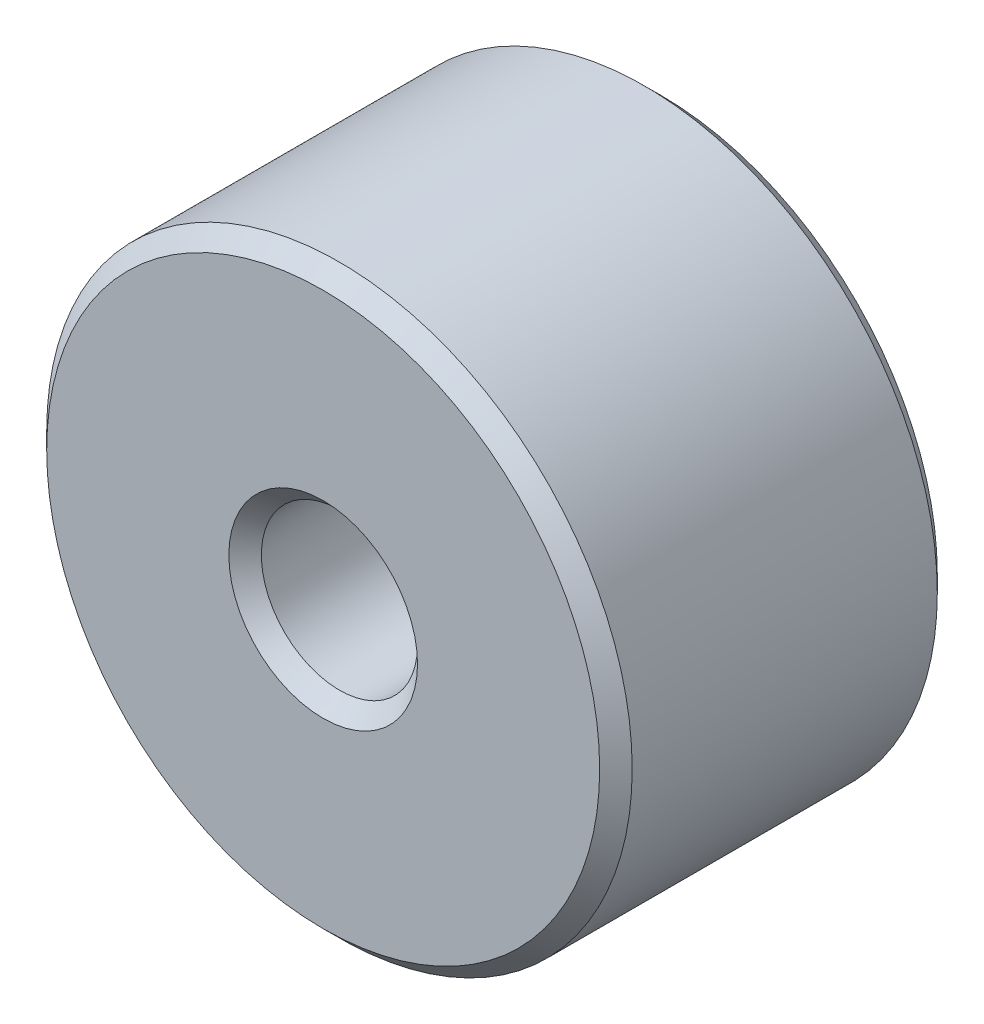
from build123d import *

# Parameters (mm, degrees)
SKETCH1_R           = 9
SKETCH1_R_2         = 2.4
BOSS_EXTRUDE1_DEPTH = 5.19
CHAMFER1_SIZE       = 0.5


with BuildPart() as part:
    # Sketch1 → Boss-Extrude1 (new, symmetric)
    with BuildSketch(Plane.XY):
        Circle(SKETCH1_R)
        Circle(SKETCH1_R_2, mode=Mode.SUBTRACT)
    extrude(amount=BOSS_EXTRUDE1_DEPTH, both=True)

    # Chamfer1
    chamfer1_edges = [part.edges().sort_by_distance(p)[0] for p in [
        (-9, 0, -5.19),
        (-9, 0, 5.19),
        (-2.4, 0, -5.19),
        (-2.4, 0, 5.19),
    ]]
    chamfer(chamfer1_edges, length=CHAMFER1_SIZE)


solid = part.part
